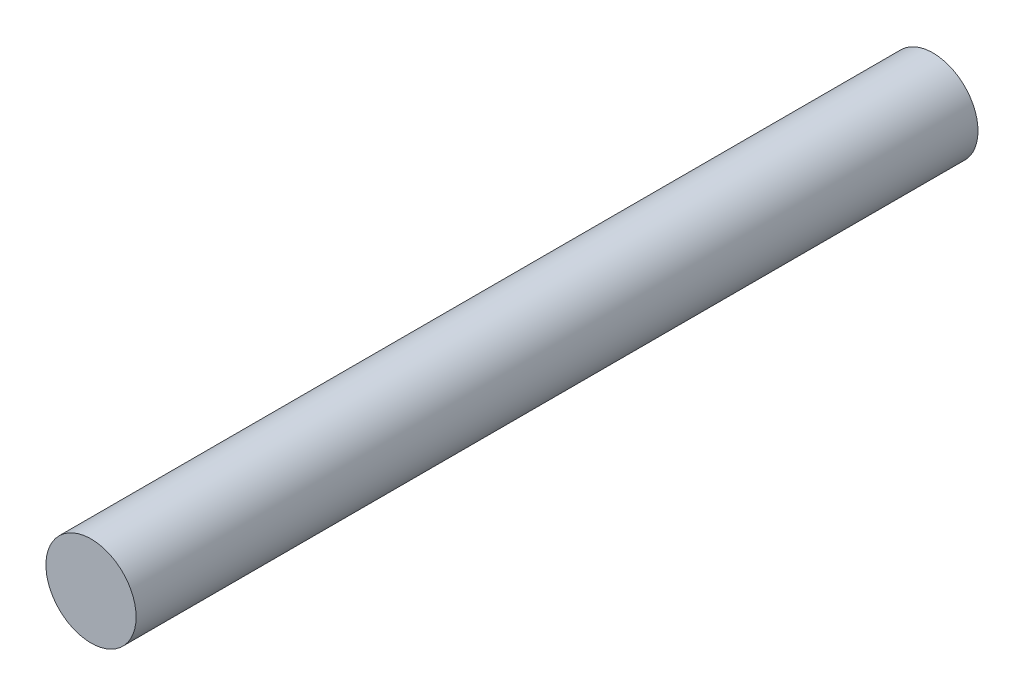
from build123d import *

# Parameters (mm, degrees)
SKETCH1_R      = 4.7625
EXTRUDE1_DEPTH = 88.9


with BuildPart() as part:
    # Sketch1 → Extrude1 (new body)
    with BuildSketch(Plane.XY):
        Circle(SKETCH1_R)
    extrude(amount=EXTRUDE1_DEPTH)


solid = part.part
